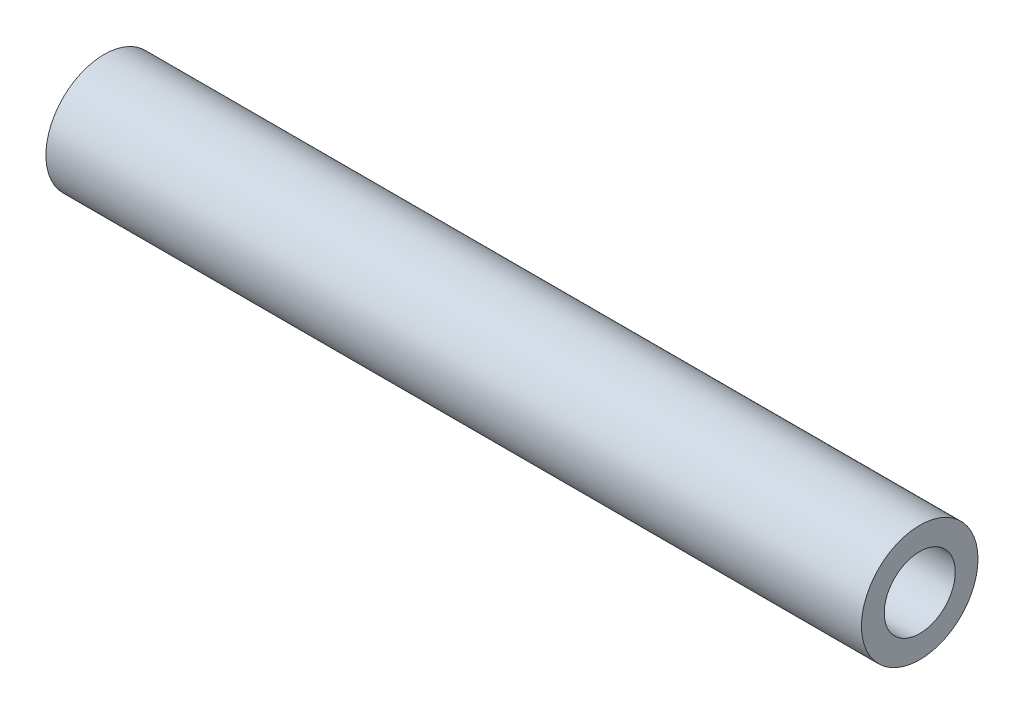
ISO-10303-21;
HEADER;
FILE_DESCRIPTION(('STEP AP214'),'2;1');
FILE_NAME('part.step','',(''),(''),'','','');
FILE_SCHEMA(('AUTOMOTIVE_DESIGN { 1 0 10303 214 1 1 1 1 }'));
ENDSEC;
DATA;
#1=APPLICATION_CONTEXT('core data for automotive mechanical design processes');
#2=APPLICATION_PROTOCOL_DEFINITION('international standard','automotive_design',2000,#1);
#3=PRODUCT_CONTEXT('',#1,'mechanical');
#4=PRODUCT('Part','Part','',(#3));
#5=PRODUCT_RELATED_PRODUCT_CATEGORY('part','',(#4));
#6=PRODUCT_DEFINITION_FORMATION('','',#4);
#7=PRODUCT_DEFINITION_CONTEXT('part definition',#1,'design');
#8=PRODUCT_DEFINITION('design','',#6,#7);
#9=PRODUCT_DEFINITION_SHAPE('','',#8);
#10=(LENGTH_UNIT() NAMED_UNIT(*) SI_UNIT(.MILLI.,.METRE.));
#11=(NAMED_UNIT(*) PLANE_ANGLE_UNIT() SI_UNIT($,.RADIAN.));
#12=(NAMED_UNIT(*) SI_UNIT($,.STERADIAN.) SOLID_ANGLE_UNIT());
#13=UNCERTAINTY_MEASURE_WITH_UNIT(LENGTH_MEASURE(1.E-05),#10,'distance_accuracy_value','');
#14=(GEOMETRIC_REPRESENTATION_CONTEXT(3) GLOBAL_UNCERTAINTY_ASSIGNED_CONTEXT((#13)) GLOBAL_UNIT_ASSIGNED_CONTEXT((#10,
#11,#12)) REPRESENTATION_CONTEXT('',''));
#15=CARTESIAN_POINT('',(0.,0.,0.));
#16=DIRECTION('',(0.,0.,1.));
#17=DIRECTION('',(1.,0.,0.));
#18=AXIS2_PLACEMENT_3D('',#15,#16,#17);
#19=CARTESIAN_POINT('',(70.,0.,0.));
#20=DIRECTION('',(1.,0.,0.));
#21=DIRECTION('',(0.,0.,-1.));
#22=AXIS2_PLACEMENT_3D('',#19,#20,#21);
#23=PLANE('',#22);
#24=CARTESIAN_POINT('',(70.,0.,0.));
#25=DIRECTION('',(1.,0.,0.));
#26=DIRECTION('',(0.,0.,-1.));
#27=AXIS2_PLACEMENT_3D('',#24,#25,#26);
#28=CIRCLE('',#27,5.);
#29=CARTESIAN_POINT('',(70.,0.,-5.));
#30=VERTEX_POINT('',#29);
#31=EDGE_CURVE('E10',#30,#30,#28,.T.);
#32=ORIENTED_EDGE('',*,*,#31,.T.);
#33=EDGE_LOOP('',(#32));
#34=FACE_BOUND('',#33,.T.);
#35=CARTESIAN_POINT('',(70.,0.,0.));
#36=DIRECTION('',(1.,0.,0.));
#37=DIRECTION('',(0.,0.,-1.));
#38=AXIS2_PLACEMENT_3D('',#35,#36,#37);
#39=CIRCLE('',#38,3.05);
#40=CARTESIAN_POINT('',(70.,0.,-3.05));
#41=VERTEX_POINT('',#40);
#42=EDGE_CURVE('E41',#41,#41,#39,.T.);
#43=ORIENTED_EDGE('',*,*,#42,.F.);
#44=EDGE_LOOP('',(#43));
#45=FACE_BOUND('',#44,.T.);
#46=ADVANCED_FACE('F30',(#34,#45),#23,.T.);
#47=CARTESIAN_POINT('',(0.,0.,0.));
#48=DIRECTION('',(1.,0.,0.));
#49=DIRECTION('',(0.,0.,-1.));
#50=AXIS2_PLACEMENT_3D('',#47,#48,#49);
#51=PLANE('',#50);
#52=CARTESIAN_POINT('',(0.,0.,0.));
#53=DIRECTION('',(1.,0.,0.));
#54=DIRECTION('',(0.,0.,-1.));
#55=AXIS2_PLACEMENT_3D('',#52,#53,#54);
#56=CIRCLE('',#55,5.);
#57=CARTESIAN_POINT('',(0.,0.,-5.));
#58=VERTEX_POINT('',#57);
#59=EDGE_CURVE('E34',#58,#58,#56,.T.);
#60=ORIENTED_EDGE('',*,*,#59,.F.);
#61=EDGE_LOOP('',(#60));
#62=FACE_BOUND('',#61,.T.);
#63=CARTESIAN_POINT('',(0.,0.,0.));
#64=DIRECTION('',(1.,0.,0.));
#65=DIRECTION('',(0.,0.,-1.));
#66=AXIS2_PLACEMENT_3D('',#63,#64,#65);
#67=CIRCLE('',#66,3.05);
#68=CARTESIAN_POINT('',(0.,0.,-3.05));
#69=VERTEX_POINT('',#68);
#70=EDGE_CURVE('E43',#69,#69,#67,.T.);
#71=ORIENTED_EDGE('',*,*,#70,.T.);
#72=EDGE_LOOP('',(#71));
#73=FACE_BOUND('',#72,.T.);
#74=ADVANCED_FACE('F53',(#62,#73),#51,.F.);
#75=CARTESIAN_POINT('',(70.,0.,0.));
#76=DIRECTION('',(-1.,0.,0.));
#77=DIRECTION('',(0.,0.,1.));
#78=AXIS2_PLACEMENT_3D('',#75,#76,#77);
#79=CYLINDRICAL_SURFACE('',#78,5.);
#80=ORIENTED_EDGE('',*,*,#31,.F.);
#81=EDGE_LOOP('',(#80));
#82=FACE_BOUND('',#81,.T.);
#83=ORIENTED_EDGE('',*,*,#59,.T.);
#84=EDGE_LOOP('',(#83));
#85=FACE_BOUND('',#84,.T.);
#86=ADVANCED_FACE('F32',(#82,#85),#79,.T.);
#87=CARTESIAN_POINT('',(70.,0.,0.));
#88=DIRECTION('',(-1.,0.,0.));
#89=DIRECTION('',(0.,0.,1.));
#90=AXIS2_PLACEMENT_3D('',#87,#88,#89);
#91=CYLINDRICAL_SURFACE('',#90,3.05);
#92=ORIENTED_EDGE('',*,*,#42,.T.);
#93=EDGE_LOOP('',(#92));
#94=FACE_BOUND('',#93,.T.);
#95=ORIENTED_EDGE('',*,*,#70,.F.);
#96=EDGE_LOOP('',(#95));
#97=FACE_BOUND('',#96,.T.);
#98=ADVANCED_FACE('F49',(#94,#97),#91,.F.);
#99=CLOSED_SHELL('',(#46,#74,#86,#98));
#100=MANIFOLD_SOLID_BREP('B2',#99);
#101=ADVANCED_BREP_SHAPE_REPRESENTATION('',(#18,#100),#14);
#102=SHAPE_DEFINITION_REPRESENTATION(#9,#101);
ENDSEC;
END-ISO-10303-21;
